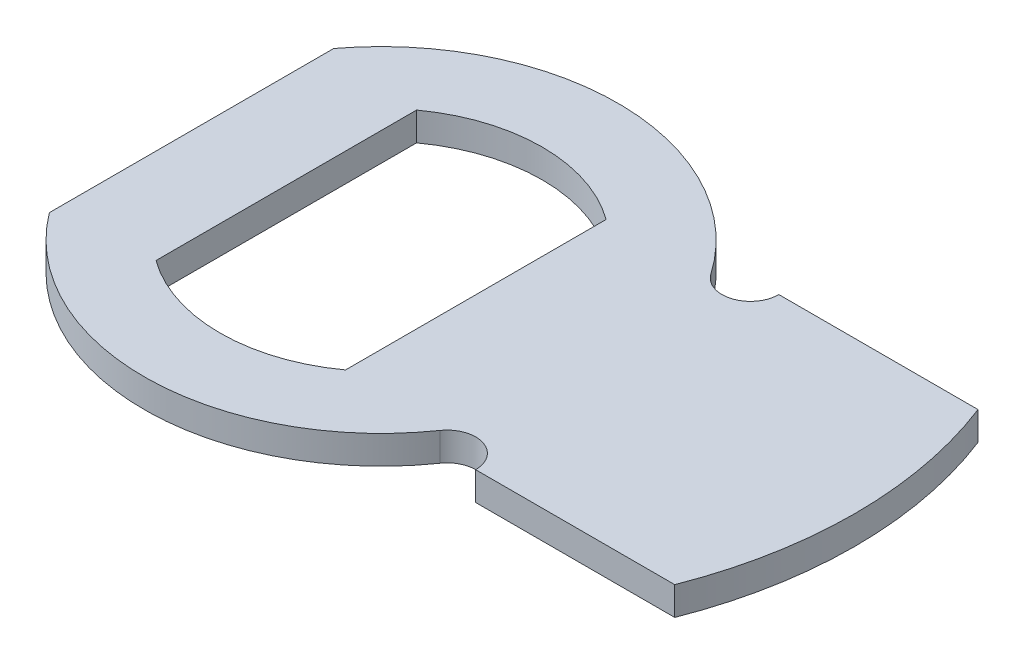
from build123d import *

# Parameters (mm, degrees)
EXTRUDE1_DEPTH = 3


with BuildPart() as part:
    # Sketch1 → Extrude1 (new body)
    with BuildSketch(Plane(origin=(0, 0, 0), x_dir=(1, 0, 0), z_dir=(0, 1, 0))):
        with BuildLine():
            Line((-20, 15), (-20, -15))
            ThreePointArc((-20, -15), (0.4406713, -24.996115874), (20.516295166, -14.285714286))
            ThreePointArc((20.516295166, -14.285714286), (23.876619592, -13.137669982), (25.978250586, -16))
            Line((25.978250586, -16), (46.987803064, -16))
            ThreePointArc((46.987803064, -16), (50, 0), (46.987803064, 16))
            Line((46.987803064, 16), (25.978250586, 16))
            ThreePointArc((25.978250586, 16), (23.876619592, 13.137669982), (20.516295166, 14.285714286))
            ThreePointArc((20.516295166, 14.285714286), (0.4406713, 24.996115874), (-20, 15))
        make_face()
        with BuildLine():
            Line((10, 13.747727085), (10, -13.747727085))
            ThreePointArc((10, -13.747727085), (0, -17), (-10, -13.747727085))
            Line((-10, -13.747727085), (-10, 13.747727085))
            ThreePointArc((-10, 13.747727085), (0, 17), (10, 13.747727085))
        make_face(mode=Mode.SUBTRACT)
    extrude(amount=EXTRUDE1_DEPTH)


solid = part.part
